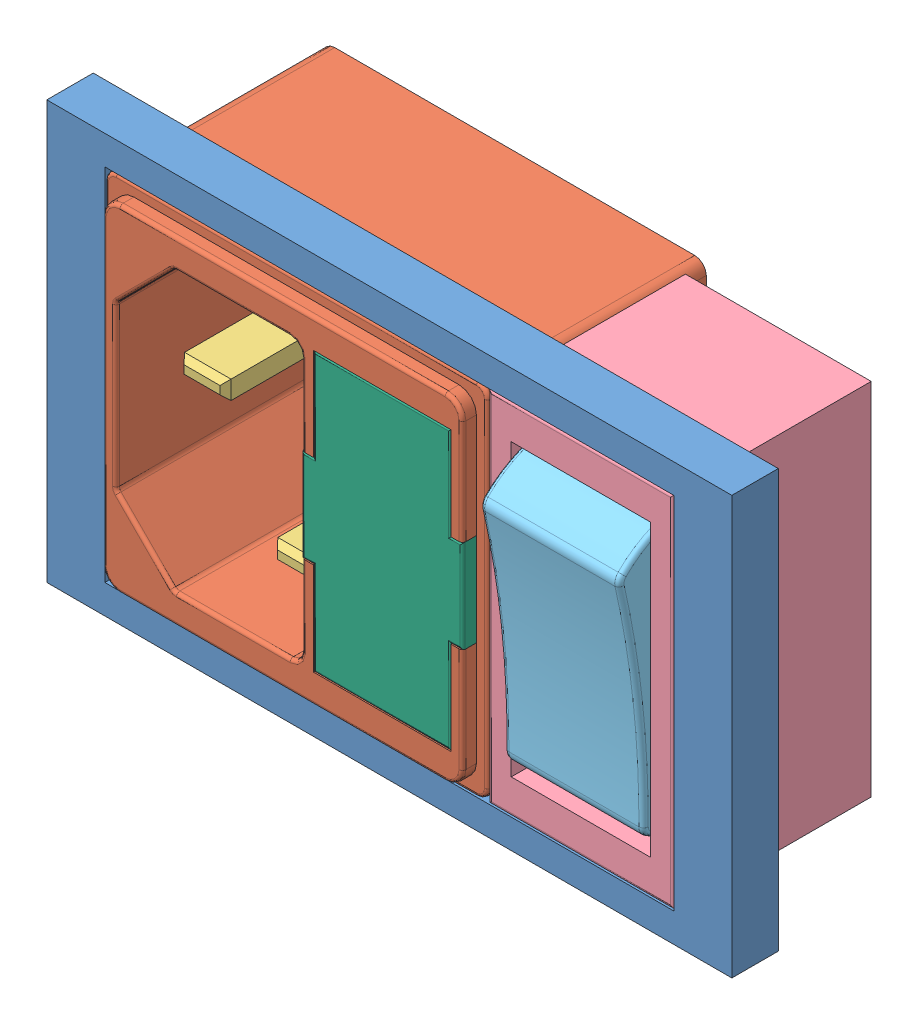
SolidWorks assembly BoitierAlim230V.SLDASM, configuration Défaut (file format 13000). Lengths in mm.
Overall size (59 36 21.78).
10 component instances, 6 part files, 9 mates.
Components (placement in the parent):
- BAlim_Base-1: BAlim_Base.SLDPRT [Défaut] at (-60.9854 -8.3122 -2) size (59 36 4)
- BAlim_Bloc-1: BAlim_Bloc.SLDASM [Défaut] at (-69.5869 10.6105 -6.8) x (-1 0 0) z (0 0 1) size (33 31 20)
  - BAlim_Bloc-1: BAlim_Bloc.SLDPRT [Défaut] at (-46.6014 -14.5774 -10) size (33 31 20)
  - BAlim_Pin-1: BAlim_Pin.SLDPRT [Défaut] at (-28.2007 9.9113 -10) size (4 1.6 15)
  - BAlim_Pin-2: BAlim_Pin.SLDPRT [Défaut] at (-20.1655 0.1226 -10) size (4 1.6 15)
  - BAlim_Pin-3: BAlim_Pin.SLDPRT [Défaut] at (-28.2007 -9.666 -10) size (4 1.6 15)
- BAlim_Inter-1: BAlim_Inter.SLDASM [Défaut] at (11.4254 -5.0746 -6.5) size (16 31 19.98)
  - BAlim_CorpsInter-1: BAlim_CorpsInter.SLDPRT [Défaut] at (-34.4108 -0.7376 -8.5) size (16 31 17)
  - BAlim_Inter-1: BAlim_Inter.SLDPRT [Défaut] at (-32.4108 1.7879 8.8603) x (0 0.107795 -0.994173) z (1 0 0) size (11.95 24.8 12)
- BAlim_TiroirFusible-1: BAlim_TiroirFusible.SLDPRT [Défaut] at (-23.9854 21.6878 -13.8) x (-1 0 0) z (0 0 1) size (13.85 24 17)
Mates (geometry in assembly coordinates):
- Coïncidente3: coincident anti-aligned: plane of BAlim_Base-1 through (-55.9854 25.1878 -2.001) normal (0 -1 0); plane of BAlim_Bloc-1/BAlim_Bloc-1 through (-23.9854 25.1878 3.2) normal (0 1 0)
- Coïncidente2: coincident anti-aligned: plane of BAlim_Base-1 through (-55.9854 25.1878 -2.001) normal (1 0 0); plane of BAlim_Bloc-1/BAlim_Bloc-1 through (-55.9854 24.1878 3.2) normal (-1 0 0)
- Coïncidente4: coincident aligned: plane of BAlim_Base-1 through (-60.9854 27.6878 2) normal (0 0 1); plane of BAlim_Bloc-1/BAlim_Bloc-1 through (-39.4854 9.6878 2) normal (0 0 1)
- Coïncidente5: coincident anti-aligned: plane of BAlim_Base-1 through (-6.9854 25.1878 -2.001) normal (-1 0 0); plane of BAlim_Inter-1/BAlim_CorpsInter-1 through (-6.9854 -5.8122 2) normal (1 0 0)
- Coïncidente6: coincident anti-aligned: plane of BAlim_Base-1 through (-55.9854 25.1878 -2.001) normal (0 -1 0); plane of BAlim_Inter-1/BAlim_CorpsInter-1 through (-22.9854 25.1878 2) normal (0 1 0)
- Coïncidente7: coincident aligned: plane of BAlim_Base-1 through (-60.9854 27.6878 2) normal (0 0 1); plane of BAlim_Inter-1/BAlim_CorpsInter-1 through (-22.9854 25.1878 2) normal (0 0 1)
- Coïncidente8: coincident anti-aligned: plane of BAlim_Bloc-1/BAlim_Bloc-1 through (-23.9854 5.6878 -13.8) normal (-1 0 0); plane of BAlim_TiroirFusible-1 through (-23.9854 13.6878 3.2) normal (1 0 0)
- Coïncidente9: coincident aligned: plane of BAlim_Bloc-1/BAlim_Bloc-1 through (-23.9854 -4.8122 3.2) normal (0 0 1); plane of BAlim_TiroirFusible-1 through (-36.8354 21.6878 3.2) normal (0 0 1)
- Coïncidente10: coincident anti-aligned: plane of BAlim_Bloc-1/BAlim_Bloc-1 through (-36.8345 -2.3122 -13.8) normal (0 1 0); plane of BAlim_TiroirFusible-1 through (-24.9854 -2.3122 3.2) normal (0 -1 0)
